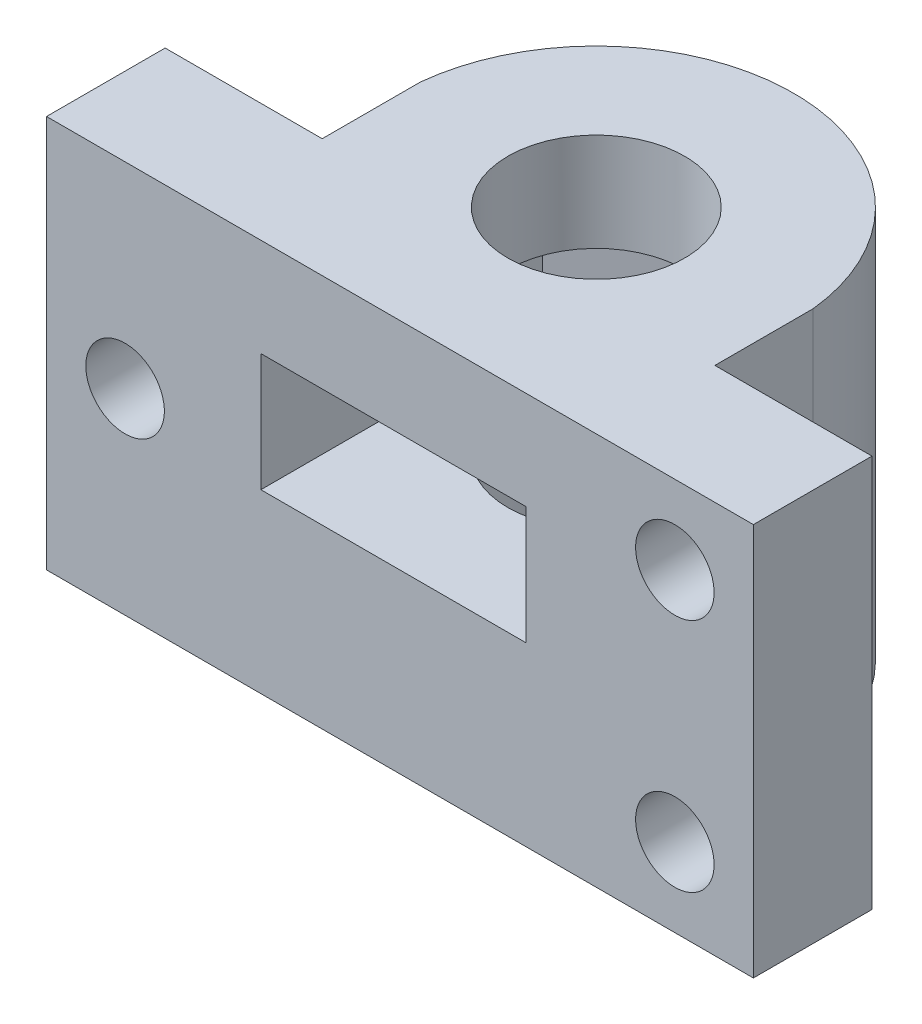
ISO-10303-21;
HEADER;
FILE_DESCRIPTION(('STEP AP214'),'2;1');
FILE_NAME('part.step','',(''),(''),'','','');
FILE_SCHEMA(('AUTOMOTIVE_DESIGN { 1 0 10303 214 1 1 1 1 }'));
ENDSEC;
DATA;
#1=APPLICATION_CONTEXT('core data for automotive mechanical design processes');
#2=APPLICATION_PROTOCOL_DEFINITION('international standard','automotive_design',2000,#1);
#3=PRODUCT_CONTEXT('',#1,'mechanical');
#4=PRODUCT('Part','Part','',(#3));
#5=PRODUCT_RELATED_PRODUCT_CATEGORY('part','',(#4));
#6=PRODUCT_DEFINITION_FORMATION('','',#4);
#7=PRODUCT_DEFINITION_CONTEXT('part definition',#1,'design');
#8=PRODUCT_DEFINITION('design','',#6,#7);
#9=PRODUCT_DEFINITION_SHAPE('','',#8);
#10=(LENGTH_UNIT() NAMED_UNIT(*) SI_UNIT(.MILLI.,.METRE.));
#11=(NAMED_UNIT(*) PLANE_ANGLE_UNIT() SI_UNIT($,.RADIAN.));
#12=(NAMED_UNIT(*) SI_UNIT($,.STERADIAN.) SOLID_ANGLE_UNIT());
#13=UNCERTAINTY_MEASURE_WITH_UNIT(LENGTH_MEASURE(1.E-05),#10,'distance_accuracy_value','');
#14=(GEOMETRIC_REPRESENTATION_CONTEXT(3) GLOBAL_UNCERTAINTY_ASSIGNED_CONTEXT((#13)) GLOBAL_UNIT_ASSIGNED_CONTEXT((#10,
#11,#12)) REPRESENTATION_CONTEXT('',''));
#15=CARTESIAN_POINT('',(0.,0.,0.));
#16=DIRECTION('',(0.,0.,1.));
#17=DIRECTION('',(1.,0.,0.));
#18=AXIS2_PLACEMENT_3D('',#15,#16,#17);
#19=CARTESIAN_POINT('',(10.,20.,-10.));
#20=DIRECTION('',(0.,-1.,0.));
#21=DIRECTION('',(0.,0.,-1.));
#22=AXIS2_PLACEMENT_3D('',#19,#20,#21);
#23=CYLINDRICAL_SURFACE('',#22,4.5);
#24=DIRECTION('',(0.,-1.,0.));
#25=VECTOR('',#24,1.);
#26=CARTESIAN_POINT('',(12.4832774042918,20.,-6.2472232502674));
#27=LINE('',#26,#25);
#28=CARTESIAN_POINT('',(12.4832774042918,9.,-6.2472232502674));
#29=VERTEX_POINT('',#28);
#30=CARTESIAN_POINT('',(12.4832774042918,8.9958407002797,-6.2472232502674));
#31=VERTEX_POINT('',#30);
#32=EDGE_CURVE('E248',#29,#31,#27,.T.);
#33=ORIENTED_EDGE('',*,*,#32,.F.);
#34=CARTESIAN_POINT('',(10.,9.,-10.));
#35=DIRECTION('',(0.,1.,0.));
#36=DIRECTION('',(0.,0.,1.));
#37=AXIS2_PLACEMENT_3D('',#34,#35,#36);
#38=CIRCLE('',#37,4.5);
#39=CARTESIAN_POINT('',(7.51672259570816,9.,-6.2472232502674));
#40=VERTEX_POINT('',#39);
#41=EDGE_CURVE('E178',#29,#40,#38,.T.);
#42=ORIENTED_EDGE('',*,*,#41,.T.);
#43=DIRECTION('',(0.,-1.,0.));
#44=VECTOR('',#43,1.);
#45=CARTESIAN_POINT('',(7.51672259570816,20.,-6.2472232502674));
#46=LINE('',#45,#44);
#47=CARTESIAN_POINT('',(7.51672259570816,8.9958407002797,-6.2472232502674));
#48=VERTEX_POINT('',#47);
#49=EDGE_CURVE('E244',#48,#40,#46,.F.);
#50=ORIENTED_EDGE('',*,*,#49,.F.);
#51=CARTESIAN_POINT('',(10.,8.9958407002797,-10.));
#52=DIRECTION('',(0.,-1.,0.));
#53=DIRECTION('',(0.,0.,-1.));
#54=AXIS2_PLACEMENT_3D('',#51,#52,#53);
#55=CIRCLE('',#54,4.5);
#56=EDGE_CURVE('E259',#31,#48,#55,.T.);
#57=ORIENTED_EDGE('',*,*,#56,.F.);
#58=EDGE_LOOP('',(#33,#42,#50,#57));
#59=FACE_BOUND('',#58,.T.);
#60=CARTESIAN_POINT('',(10.,0.,-10.));
#61=DIRECTION('',(0.,1.,0.));
#62=DIRECTION('',(0.,0.,1.));
#63=AXIS2_PLACEMENT_3D('',#60,#61,#62);
#64=CIRCLE('',#63,4.5);
#65=CARTESIAN_POINT('',(10.,0.,-5.5));
#66=VERTEX_POINT('',#65);
#67=EDGE_CURVE('E182',#66,#66,#64,.T.);
#68=ORIENTED_EDGE('',*,*,#67,.F.);
#69=EDGE_LOOP('',(#68));
#70=FACE_BOUND('',#69,.T.);
#71=ADVANCED_FACE('F33',(#59,#70),#23,.F.);
#72=CARTESIAN_POINT('',(10.,20.,-10.));
#73=DIRECTION('',(0.,-1.,0.));
#74=DIRECTION('',(0.,0.,-1.));
#75=AXIS2_PLACEMENT_3D('',#72,#73,#74);
#76=PLANE('',#75);
#77=DIRECTION('',(1.,0.,0.));
#78=VECTOR('',#77,1.);
#79=CARTESIAN_POINT('',(0.,20.,0.));
#80=LINE('',#79,#78);
#81=CARTESIAN_POINT('',(-8.,20.,0.));
#82=VERTEX_POINT('',#81);
#83=CARTESIAN_POINT('',(28.,20.,0.));
#84=VERTEX_POINT('',#83);
#85=EDGE_CURVE('E96',#82,#84,#80,.T.);
#86=ORIENTED_EDGE('',*,*,#85,.T.);
#87=DIRECTION('',(0.,0.,-1.));
#88=VECTOR('',#87,1.);
#89=CARTESIAN_POINT('',(28.,20.,0.));
#90=LINE('',#89,#88);
#91=CARTESIAN_POINT('',(28.,20.,-6.03995723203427));
#92=VERTEX_POINT('',#91);
#93=EDGE_CURVE('E328',#84,#92,#90,.T.);
#94=ORIENTED_EDGE('',*,*,#93,.T.);
#95=DIRECTION('',(-1.,0.,0.));
#96=VECTOR('',#95,1.);
#97=CARTESIAN_POINT('',(28.,20.,-6.03995723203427));
#98=LINE('',#97,#96);
#99=CARTESIAN_POINT('',(20.,20.,-6.03995723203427));
#100=VERTEX_POINT('',#99);
#101=EDGE_CURVE('E330',#92,#100,#98,.T.);
#102=ORIENTED_EDGE('',*,*,#101,.T.);
#103=DIRECTION('',(0.,0.,-1.));
#104=VECTOR('',#103,1.);
#105=CARTESIAN_POINT('',(20.,20.,-6.03995723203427));
#106=LINE('',#105,#104);
#107=CARTESIAN_POINT('',(20.,20.,-11.0399572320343));
#108=VERTEX_POINT('',#107);
#109=EDGE_CURVE('E332',#100,#108,#106,.T.);
#110=ORIENTED_EDGE('',*,*,#109,.T.);
#111=CARTESIAN_POINT('',(10.,20.,-10.));
#112=DIRECTION('',(0.,1.,0.));
#113=DIRECTION('',(0.,0.,-1.));
#114=AXIS2_PLACEMENT_3D('',#111,#112,#113);
#115=CIRCLE('',#114,10.0539301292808);
#116=CARTESIAN_POINT('',(0.,20.,-11.0399572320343));
#117=VERTEX_POINT('',#116);
#118=EDGE_CURVE('E121',#108,#117,#115,.T.);
#119=ORIENTED_EDGE('',*,*,#118,.T.);
#120=DIRECTION('',(0.,0.,1.));
#121=VECTOR('',#120,1.);
#122=CARTESIAN_POINT('',(0.,20.,-11.0399572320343));
#123=LINE('',#122,#121);
#124=CARTESIAN_POINT('',(0.,20.,-6.03995723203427));
#125=VERTEX_POINT('',#124);
#126=EDGE_CURVE('E113',#117,#125,#123,.T.);
#127=ORIENTED_EDGE('',*,*,#126,.T.);
#128=DIRECTION('',(-1.,0.,0.));
#129=VECTOR('',#128,1.);
#130=CARTESIAN_POINT('',(-8.,20.,-6.03995723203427));
#131=LINE('',#130,#129);
#132=CARTESIAN_POINT('',(-8.,20.,-6.03995723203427));
#133=VERTEX_POINT('',#132);
#134=EDGE_CURVE('E118',#125,#133,#131,.T.);
#135=ORIENTED_EDGE('',*,*,#134,.T.);
#136=DIRECTION('',(0.,0.,1.));
#137=VECTOR('',#136,1.);
#138=CARTESIAN_POINT('',(-8.,20.,0.));
#139=LINE('',#138,#137);
#140=EDGE_CURVE('E57',#133,#82,#139,.T.);
#141=ORIENTED_EDGE('',*,*,#140,.T.);
#142=EDGE_LOOP('',(#86,#94,#102,#110,#119,#127,#135,#141));
#143=FACE_BOUND('',#142,.T.);
#144=CARTESIAN_POINT('',(10.,20.,-10.));
#145=DIRECTION('',(0.,1.,0.));
#146=DIRECTION('',(0.,0.,1.));
#147=AXIS2_PLACEMENT_3D('',#144,#145,#146);
#148=CIRCLE('',#147,4.5);
#149=CARTESIAN_POINT('',(10.,20.,-5.5));
#150=VERTEX_POINT('',#149);
#151=EDGE_CURVE('E145',#150,#150,#148,.T.);
#152=ORIENTED_EDGE('',*,*,#151,.F.);
#153=EDGE_LOOP('',(#152));
#154=FACE_BOUND('',#153,.T.);
#155=ADVANCED_FACE('F115',(#143,#154),#76,.F.);
#156=CARTESIAN_POINT('',(10.,0.,-10.));
#157=DIRECTION('',(0.,-1.,0.));
#158=DIRECTION('',(0.,0.,-1.));
#159=AXIS2_PLACEMENT_3D('',#156,#157,#158);
#160=PLANE('',#159);
#161=DIRECTION('',(1.,0.,0.));
#162=VECTOR('',#161,1.);
#163=CARTESIAN_POINT('',(20.,0.,0.));
#164=LINE('',#163,#162);
#165=CARTESIAN_POINT('',(-8.,0.,0.));
#166=VERTEX_POINT('',#165);
#167=CARTESIAN_POINT('',(28.,0.,0.));
#168=VERTEX_POINT('',#167);
#169=EDGE_CURVE('E90',#166,#168,#164,.T.);
#170=ORIENTED_EDGE('',*,*,#169,.F.);
#171=DIRECTION('',(0.,0.,1.));
#172=VECTOR('',#171,1.);
#173=CARTESIAN_POINT('',(-8.,0.,0.));
#174=LINE('',#173,#172);
#175=CARTESIAN_POINT('',(-8.,0.,-6.03995723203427));
#176=VERTEX_POINT('',#175);
#177=EDGE_CURVE('E156',#176,#166,#174,.T.);
#178=ORIENTED_EDGE('',*,*,#177,.F.);
#179=DIRECTION('',(-1.,0.,0.));
#180=VECTOR('',#179,1.);
#181=CARTESIAN_POINT('',(-8.,0.,-6.03995723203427));
#182=LINE('',#181,#180);
#183=CARTESIAN_POINT('',(0.,0.,-6.03995723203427));
#184=VERTEX_POINT('',#183);
#185=EDGE_CURVE('E154',#184,#176,#182,.T.);
#186=ORIENTED_EDGE('',*,*,#185,.F.);
#187=DIRECTION('',(0.,0.,1.));
#188=VECTOR('',#187,1.);
#189=CARTESIAN_POINT('',(0.,0.,-11.0399572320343));
#190=LINE('',#189,#188);
#191=CARTESIAN_POINT('',(0.,0.,-11.0399572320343));
#192=VERTEX_POINT('',#191);
#193=EDGE_CURVE('E130',#192,#184,#190,.T.);
#194=ORIENTED_EDGE('',*,*,#193,.F.);
#195=CARTESIAN_POINT('',(10.,0.,-10.));
#196=DIRECTION('',(0.,1.,0.));
#197=DIRECTION('',(0.,0.,-1.));
#198=AXIS2_PLACEMENT_3D('',#195,#196,#197);
#199=CIRCLE('',#198,10.0539301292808);
#200=CARTESIAN_POINT('',(20.,0.,-11.0399572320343));
#201=VERTEX_POINT('',#200);
#202=EDGE_CURVE('E151',#201,#192,#199,.T.);
#203=ORIENTED_EDGE('',*,*,#202,.F.);
#204=DIRECTION('',(0.,0.,-1.));
#205=VECTOR('',#204,1.);
#206=CARTESIAN_POINT('',(20.,0.,-6.03995723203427));
#207=LINE('',#206,#205);
#208=CARTESIAN_POINT('',(20.,0.,-6.03995723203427));
#209=VERTEX_POINT('',#208);
#210=EDGE_CURVE('E149',#209,#201,#207,.T.);
#211=ORIENTED_EDGE('',*,*,#210,.F.);
#212=DIRECTION('',(-1.,0.,0.));
#213=VECTOR('',#212,1.);
#214=CARTESIAN_POINT('',(28.,0.,-6.03995723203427));
#215=LINE('',#214,#213);
#216=CARTESIAN_POINT('',(28.,0.,-6.03995723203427));
#217=VERTEX_POINT('',#216);
#218=EDGE_CURVE('E147',#217,#209,#215,.T.);
#219=ORIENTED_EDGE('',*,*,#218,.F.);
#220=DIRECTION('',(0.,0.,-1.));
#221=VECTOR('',#220,1.);
#222=CARTESIAN_POINT('',(28.,0.,0.));
#223=LINE('',#222,#221);
#224=EDGE_CURVE('E144',#168,#217,#223,.T.);
#225=ORIENTED_EDGE('',*,*,#224,.F.);
#226=EDGE_LOOP('',(#170,#178,#186,#194,#203,#211,#219,#225));
#227=FACE_BOUND('',#226,.T.);
#228=ORIENTED_EDGE('',*,*,#67,.T.);
#229=EDGE_LOOP('',(#228));
#230=FACE_BOUND('',#229,.T.);
#231=ADVANCED_FACE('F343',(#227,#230),#160,.T.);
#232=CARTESIAN_POINT('',(20.,20.,0.));
#233=DIRECTION('',(0.,0.,-1.));
#234=DIRECTION('',(-1.,0.,0.));
#235=AXIS2_PLACEMENT_3D('',#232,#233,#234);
#236=PLANE('',#235);
#237=DIRECTION('',(-1.,0.,0.));
#238=VECTOR('',#237,1.);
#239=CARTESIAN_POINT('',(20.,8.9958407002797,0.));
#240=LINE('',#239,#238);
#241=CARTESIAN_POINT('',(16.4104206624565,8.9958407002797,0.));
#242=VERTEX_POINT('',#241);
#243=CARTESIAN_POINT('',(2.91733404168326,8.9958407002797,0.));
#244=VERTEX_POINT('',#243);
#245=EDGE_CURVE('E41',#242,#244,#240,.T.);
#246=ORIENTED_EDGE('',*,*,#245,.T.);
#247=DIRECTION('',(0.,1.,0.));
#248=VECTOR('',#247,1.);
#249=CARTESIAN_POINT('',(2.91733404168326,20.,0.));
#250=LINE('',#249,#248);
#251=CARTESIAN_POINT('',(2.91733404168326,15.0012416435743,0.));
#252=VERTEX_POINT('',#251);
#253=EDGE_CURVE('E11',#244,#252,#250,.T.);
#254=ORIENTED_EDGE('',*,*,#253,.T.);
#255=DIRECTION('',(1.,0.,0.));
#256=VECTOR('',#255,1.);
#257=CARTESIAN_POINT('',(20.,15.0012416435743,0.));
#258=LINE('',#257,#256);
#259=CARTESIAN_POINT('',(16.4104206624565,15.0012416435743,0.));
#260=VERTEX_POINT('',#259);
#261=EDGE_CURVE('E257',#252,#260,#258,.T.);
#262=ORIENTED_EDGE('',*,*,#261,.T.);
#263=DIRECTION('',(0.,-1.,0.));
#264=VECTOR('',#263,1.);
#265=CARTESIAN_POINT('',(16.4104206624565,20.,0.));
#266=LINE('',#265,#264);
#267=EDGE_CURVE('E201',#260,#242,#266,.T.);
#268=ORIENTED_EDGE('',*,*,#267,.T.);
#269=EDGE_LOOP('',(#246,#254,#262,#268));
#270=FACE_BOUND('',#269,.T.);
#271=CARTESIAN_POINT('',(-4.,10.,0.));
#272=DIRECTION('',(0.,0.,-1.));
#273=DIRECTION('',(-1.,0.,0.));
#274=AXIS2_PLACEMENT_3D('',#271,#272,#273);
#275=CIRCLE('',#274,2.);
#276=CARTESIAN_POINT('',(-6.,10.,0.));
#277=VERTEX_POINT('',#276);
#278=EDGE_CURVE('E262',#277,#277,#275,.T.);
#279=ORIENTED_EDGE('',*,*,#278,.T.);
#280=EDGE_LOOP('',(#279));
#281=FACE_BOUND('',#280,.T.);
#282=CARTESIAN_POINT('',(24.,16.,0.));
#283=DIRECTION('',(0.,0.,-1.));
#284=DIRECTION('',(-1.,0.,0.));
#285=AXIS2_PLACEMENT_3D('',#282,#283,#284);
#286=CIRCLE('',#285,2.);
#287=CARTESIAN_POINT('',(22.,16.,0.));
#288=VERTEX_POINT('',#287);
#289=EDGE_CURVE('E268',#288,#288,#286,.T.);
#290=ORIENTED_EDGE('',*,*,#289,.T.);
#291=EDGE_LOOP('',(#290));
#292=FACE_BOUND('',#291,.T.);
#293=CARTESIAN_POINT('',(24.,4.,0.));
#294=DIRECTION('',(0.,0.,-1.));
#295=DIRECTION('',(-1.,0.,0.));
#296=AXIS2_PLACEMENT_3D('',#293,#294,#295);
#297=CIRCLE('',#296,2.);
#298=CARTESIAN_POINT('',(22.,4.,0.));
#299=VERTEX_POINT('',#298);
#300=EDGE_CURVE('E274',#299,#299,#297,.T.);
#301=ORIENTED_EDGE('',*,*,#300,.T.);
#302=EDGE_LOOP('',(#301));
#303=FACE_BOUND('',#302,.T.);
#304=ORIENTED_EDGE('',*,*,#169,.T.);
#305=DIRECTION('',(0.,-1.,0.));
#306=VECTOR('',#305,1.);
#307=CARTESIAN_POINT('',(28.,20.,0.));
#308=LINE('',#307,#306);
#309=EDGE_CURVE('E171',#84,#168,#308,.T.);
#310=ORIENTED_EDGE('',*,*,#309,.F.);
#311=ORIENTED_EDGE('',*,*,#85,.F.);
#312=DIRECTION('',(0.,-1.,0.));
#313=VECTOR('',#312,1.);
#314=CARTESIAN_POINT('',(-8.,20.,0.));
#315=LINE('',#314,#313);
#316=EDGE_CURVE('E139',#82,#166,#315,.T.);
#317=ORIENTED_EDGE('',*,*,#316,.T.);
#318=EDGE_LOOP('',(#304,#310,#311,#317));
#319=FACE_BOUND('',#318,.T.);
#320=ADVANCED_FACE('F35',(#270,#281,#292,#303,#319),#236,.F.);
#321=CARTESIAN_POINT('',(28.,20.,0.));
#322=DIRECTION('',(-1.,0.,0.));
#323=DIRECTION('',(0.,0.,1.));
#324=AXIS2_PLACEMENT_3D('',#321,#322,#323);
#325=PLANE('',#324);
#326=ORIENTED_EDGE('',*,*,#224,.T.);
#327=DIRECTION('',(0.,-1.,0.));
#328=VECTOR('',#327,1.);
#329=CARTESIAN_POINT('',(28.,20.,-6.03995723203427));
#330=LINE('',#329,#328);
#331=EDGE_CURVE('E168',#92,#217,#330,.T.);
#332=ORIENTED_EDGE('',*,*,#331,.F.);
#333=ORIENTED_EDGE('',*,*,#93,.F.);
#334=ORIENTED_EDGE('',*,*,#309,.T.);
#335=EDGE_LOOP('',(#326,#332,#333,#334));
#336=FACE_BOUND('',#335,.T.);
#337=ADVANCED_FACE('F351',(#336),#325,.F.);
#338=CARTESIAN_POINT('',(28.,20.,-6.03995723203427));
#339=DIRECTION('',(0.,0.,1.));
#340=DIRECTION('',(1.,0.,0.));
#341=AXIS2_PLACEMENT_3D('',#338,#339,#340);
#342=PLANE('',#341);
#343=CARTESIAN_POINT('',(24.,16.,-6.03995723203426));
#344=DIRECTION('',(0.,0.,-1.));
#345=DIRECTION('',(-1.,0.,0.));
#346=AXIS2_PLACEMENT_3D('',#343,#344,#345);
#347=CIRCLE('',#346,2.);
#348=CARTESIAN_POINT('',(22.,16.,-6.03995723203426));
#349=VERTEX_POINT('',#348);
#350=EDGE_CURVE('E265',#349,#349,#347,.T.);
#351=ORIENTED_EDGE('',*,*,#350,.F.);
#352=EDGE_LOOP('',(#351));
#353=FACE_BOUND('',#352,.T.);
#354=CARTESIAN_POINT('',(24.,4.,-6.03995723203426));
#355=DIRECTION('',(0.,0.,-1.));
#356=DIRECTION('',(-1.,0.,0.));
#357=AXIS2_PLACEMENT_3D('',#354,#355,#356);
#358=CIRCLE('',#357,2.);
#359=CARTESIAN_POINT('',(22.,4.,-6.03995723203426));
#360=VERTEX_POINT('',#359);
#361=EDGE_CURVE('E271',#360,#360,#358,.T.);
#362=ORIENTED_EDGE('',*,*,#361,.F.);
#363=EDGE_LOOP('',(#362));
#364=FACE_BOUND('',#363,.T.);
#365=ORIENTED_EDGE('',*,*,#218,.T.);
#366=DIRECTION('',(0.,-1.,0.));
#367=VECTOR('',#366,1.);
#368=CARTESIAN_POINT('',(20.,20.,-6.03995723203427));
#369=LINE('',#368,#367);
#370=EDGE_CURVE('E165',#100,#209,#369,.T.);
#371=ORIENTED_EDGE('',*,*,#370,.F.);
#372=ORIENTED_EDGE('',*,*,#101,.F.);
#373=ORIENTED_EDGE('',*,*,#331,.T.);
#374=EDGE_LOOP('',(#365,#371,#372,#373));
#375=FACE_BOUND('',#374,.T.);
#376=ADVANCED_FACE('F354',(#353,#364,#375),#342,.F.);
#377=CARTESIAN_POINT('',(20.,20.,-6.03995723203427));
#378=DIRECTION('',(-1.,0.,0.));
#379=DIRECTION('',(0.,0.,1.));
#380=AXIS2_PLACEMENT_3D('',#377,#378,#379);
#381=PLANE('',#380);
#382=ORIENTED_EDGE('',*,*,#210,.T.);
#383=DIRECTION('',(0.,-1.,0.));
#384=VECTOR('',#383,1.);
#385=CARTESIAN_POINT('',(20.,20.,-11.0399572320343));
#386=LINE('',#385,#384);
#387=EDGE_CURVE('E162',#108,#201,#386,.T.);
#388=ORIENTED_EDGE('',*,*,#387,.F.);
#389=ORIENTED_EDGE('',*,*,#109,.F.);
#390=ORIENTED_EDGE('',*,*,#370,.T.);
#391=EDGE_LOOP('',(#382,#388,#389,#390));
#392=FACE_BOUND('',#391,.T.);
#393=ADVANCED_FACE('F338',(#392),#381,.F.);
#394=CARTESIAN_POINT('',(10.,20.,-10.));
#395=DIRECTION('',(0.,-1.,0.));
#396=DIRECTION('',(0.,0.,-1.));
#397=AXIS2_PLACEMENT_3D('',#394,#395,#396);
#398=CYLINDRICAL_SURFACE('',#397,10.0539301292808);
#399=ORIENTED_EDGE('',*,*,#202,.T.);
#400=DIRECTION('',(0.,-1.,0.));
#401=VECTOR('',#400,1.);
#402=CARTESIAN_POINT('',(0.,20.,-11.0399572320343));
#403=LINE('',#402,#401);
#404=EDGE_CURVE('E133',#117,#192,#403,.T.);
#405=ORIENTED_EDGE('',*,*,#404,.F.);
#406=ORIENTED_EDGE('',*,*,#118,.F.);
#407=ORIENTED_EDGE('',*,*,#387,.T.);
#408=EDGE_LOOP('',(#399,#405,#406,#407));
#409=FACE_BOUND('',#408,.T.);
#410=ADVANCED_FACE('F342',(#409),#398,.T.);
#411=CARTESIAN_POINT('',(0.,20.,-11.0399572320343));
#412=DIRECTION('',(1.,0.,0.));
#413=DIRECTION('',(0.,0.,-1.));
#414=AXIS2_PLACEMENT_3D('',#411,#412,#413);
#415=PLANE('',#414);
#416=ORIENTED_EDGE('',*,*,#193,.T.);
#417=DIRECTION('',(0.,-1.,0.));
#418=VECTOR('',#417,1.);
#419=CARTESIAN_POINT('',(0.,20.,-6.03995723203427));
#420=LINE('',#419,#418);
#421=EDGE_CURVE('E127',#125,#184,#420,.T.);
#422=ORIENTED_EDGE('',*,*,#421,.F.);
#423=ORIENTED_EDGE('',*,*,#126,.F.);
#424=ORIENTED_EDGE('',*,*,#404,.T.);
#425=EDGE_LOOP('',(#416,#422,#423,#424));
#426=FACE_BOUND('',#425,.T.);
#427=ADVANCED_FACE('F128',(#426),#415,.F.);
#428=CARTESIAN_POINT('',(-8.,20.,-6.03995723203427));
#429=DIRECTION('',(0.,0.,1.));
#430=DIRECTION('',(1.,0.,0.));
#431=AXIS2_PLACEMENT_3D('',#428,#429,#430);
#432=PLANE('',#431);
#433=CARTESIAN_POINT('',(-4.,10.,-6.03995723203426));
#434=DIRECTION('',(0.,0.,-1.));
#435=DIRECTION('',(-1.,0.,0.));
#436=AXIS2_PLACEMENT_3D('',#433,#434,#435);
#437=CIRCLE('',#436,2.);
#438=CARTESIAN_POINT('',(-6.,10.,-6.03995723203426));
#439=VERTEX_POINT('',#438);
#440=EDGE_CURVE('E261',#439,#439,#437,.T.);
#441=ORIENTED_EDGE('',*,*,#440,.F.);
#442=EDGE_LOOP('',(#441));
#443=FACE_BOUND('',#442,.T.);
#444=ORIENTED_EDGE('',*,*,#185,.T.);
#445=DIRECTION('',(0.,-1.,0.));
#446=VECTOR('',#445,1.);
#447=CARTESIAN_POINT('',(-8.,20.,-6.03995723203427));
#448=LINE('',#447,#446);
#449=EDGE_CURVE('E134',#133,#176,#448,.T.);
#450=ORIENTED_EDGE('',*,*,#449,.F.);
#451=ORIENTED_EDGE('',*,*,#134,.F.);
#452=ORIENTED_EDGE('',*,*,#421,.T.);
#453=EDGE_LOOP('',(#444,#450,#451,#452));
#454=FACE_BOUND('',#453,.T.);
#455=ADVANCED_FACE('F136',(#443,#454),#432,.F.);
#456=CARTESIAN_POINT('',(-8.,20.,0.));
#457=DIRECTION('',(1.,0.,0.));
#458=DIRECTION('',(0.,0.,-1.));
#459=AXIS2_PLACEMENT_3D('',#456,#457,#458);
#460=PLANE('',#459);
#461=ORIENTED_EDGE('',*,*,#177,.T.);
#462=ORIENTED_EDGE('',*,*,#316,.F.);
#463=ORIENTED_EDGE('',*,*,#140,.F.);
#464=ORIENTED_EDGE('',*,*,#449,.T.);
#465=EDGE_LOOP('',(#461,#462,#463,#464));
#466=FACE_BOUND('',#465,.T.);
#467=ADVANCED_FACE('F346',(#466),#460,.F.);
#468=DIRECTION('',(0.,-1.,0.));
#469=VECTOR('',#468,1.);
#470=CARTESIAN_POINT('',(12.4832774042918,20.,-6.2472232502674));
#471=LINE('',#470,#469);
#472=CARTESIAN_POINT('',(12.4832774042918,15.0012416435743,-6.2472232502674));
#473=VERTEX_POINT('',#472);
#474=CARTESIAN_POINT('',(12.4832774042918,15.,-6.2472232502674));
#475=VERTEX_POINT('',#474);
#476=EDGE_CURVE('E238',#473,#475,#471,.T.);
#477=ORIENTED_EDGE('',*,*,#476,.F.);
#478=CARTESIAN_POINT('',(10.,15.0012416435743,-10.));
#479=DIRECTION('',(0.,1.,0.));
#480=DIRECTION('',(0.,0.,1.));
#481=AXIS2_PLACEMENT_3D('',#478,#479,#480);
#482=CIRCLE('',#481,4.5);
#483=CARTESIAN_POINT('',(7.51672259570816,15.0012416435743,-6.2472232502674));
#484=VERTEX_POINT('',#483);
#485=EDGE_CURVE('E189',#484,#473,#482,.T.);
#486=ORIENTED_EDGE('',*,*,#485,.F.);
#487=DIRECTION('',(0.,-1.,0.));
#488=VECTOR('',#487,1.);
#489=CARTESIAN_POINT('',(7.51672259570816,20.,-6.2472232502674));
#490=LINE('',#489,#488);
#491=CARTESIAN_POINT('',(7.51672259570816,15.,-6.2472232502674));
#492=VERTEX_POINT('',#491);
#493=EDGE_CURVE('E227',#492,#484,#490,.F.);
#494=ORIENTED_EDGE('',*,*,#493,.F.);
#495=CARTESIAN_POINT('',(10.,15.,-10.));
#496=DIRECTION('',(0.,1.,0.));
#497=DIRECTION('',(0.,0.,1.));
#498=AXIS2_PLACEMENT_3D('',#495,#496,#497);
#499=CIRCLE('',#498,4.5);
#500=EDGE_CURVE('E175',#475,#492,#499,.T.);
#501=ORIENTED_EDGE('',*,*,#500,.F.);
#502=EDGE_LOOP('',(#477,#486,#494,#501));
#503=FACE_BOUND('',#502,.T.);
#504=ORIENTED_EDGE('',*,*,#151,.T.);
#505=EDGE_LOOP('',(#504));
#506=FACE_BOUND('',#505,.T.);
#507=ADVANCED_FACE('F368',(#503,#506),#23,.F.);
#508=CARTESIAN_POINT('',(3.49999999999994,9.,-13.7527767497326));
#509=DIRECTION('',(-1.,0.,0.));
#510=DIRECTION('',(0.,0.,1.));
#511=AXIS2_PLACEMENT_3D('',#508,#509,#510);
#512=PLANE('',#511);
#513=DIRECTION('',(0.,0.,1.));
#514=VECTOR('',#513,1.);
#515=CARTESIAN_POINT('',(3.49999999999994,15.,-13.7527767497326));
#516=LINE('',#515,#514);
#517=CARTESIAN_POINT('',(3.49999999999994,15.,-13.7527767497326));
#518=VERTEX_POINT('',#517);
#519=CARTESIAN_POINT('',(3.49999999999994,15.,-6.2472232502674));
#520=VERTEX_POINT('',#519);
#521=EDGE_CURVE('E284',#518,#520,#516,.T.);
#522=ORIENTED_EDGE('',*,*,#521,.T.);
#523=DIRECTION('',(0.,1.,0.));
#524=VECTOR('',#523,1.);
#525=CARTESIAN_POINT('',(3.49999999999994,9.,-6.2472232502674));
#526=LINE('',#525,#524);
#527=CARTESIAN_POINT('',(3.49999999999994,9.,-6.2472232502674));
#528=VERTEX_POINT('',#527);
#529=EDGE_CURVE('E179',#528,#520,#526,.T.);
#530=ORIENTED_EDGE('',*,*,#529,.F.);
#531=DIRECTION('',(0.,0.,1.));
#532=VECTOR('',#531,1.);
#533=CARTESIAN_POINT('',(3.49999999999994,9.,-13.7527767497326));
#534=LINE('',#533,#532);
#535=CARTESIAN_POINT('',(3.49999999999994,9.,-13.7527767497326));
#536=VERTEX_POINT('',#535);
#537=EDGE_CURVE('E293',#536,#528,#534,.T.);
#538=ORIENTED_EDGE('',*,*,#537,.F.);
#539=DIRECTION('',(0.,1.,0.));
#540=VECTOR('',#539,1.);
#541=CARTESIAN_POINT('',(3.49999999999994,9.,-13.7527767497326));
#542=LINE('',#541,#540);
#543=EDGE_CURVE('E312',#536,#518,#542,.T.);
#544=ORIENTED_EDGE('',*,*,#543,.T.);
#545=EDGE_LOOP('',(#522,#530,#538,#544));
#546=FACE_BOUND('',#545,.T.);
#547=ADVANCED_FACE('F377',(#546),#512,.F.);
#548=CARTESIAN_POINT('',(10.,9.,-17.5055534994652));
#549=DIRECTION('',(-0.5,0.,-0.866025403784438));
#550=DIRECTION('',(-0.866025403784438,0.,0.5));
#551=AXIS2_PLACEMENT_3D('',#548,#549,#550);
#552=PLANE('',#551);
#553=DIRECTION('',(-0.866025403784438,0.,0.5));
#554=VECTOR('',#553,1.);
#555=CARTESIAN_POINT('',(10.,15.,-17.5055534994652));
#556=LINE('',#555,#554);
#557=CARTESIAN_POINT('',(10.,15.,-17.5055534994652));
#558=VERTEX_POINT('',#557);
#559=EDGE_CURVE('E305',#558,#518,#556,.T.);
#560=ORIENTED_EDGE('',*,*,#559,.T.);
#561=ORIENTED_EDGE('',*,*,#543,.F.);
#562=DIRECTION('',(-0.866025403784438,0.,0.5));
#563=VECTOR('',#562,1.);
#564=CARTESIAN_POINT('',(10.,9.,-17.5055534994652));
#565=LINE('',#564,#563);
#566=CARTESIAN_POINT('',(10.,9.,-17.5055534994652));
#567=VERTEX_POINT('',#566);
#568=EDGE_CURVE('E290',#567,#536,#565,.T.);
#569=ORIENTED_EDGE('',*,*,#568,.F.);
#570=DIRECTION('',(0.,1.,0.));
#571=VECTOR('',#570,1.);
#572=CARTESIAN_POINT('',(10.,9.,-17.5055534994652));
#573=LINE('',#572,#571);
#574=EDGE_CURVE('E315',#567,#558,#573,.T.);
#575=ORIENTED_EDGE('',*,*,#574,.T.);
#576=EDGE_LOOP('',(#560,#561,#569,#575));
#577=FACE_BOUND('',#576,.T.);
#578=ADVANCED_FACE('F383',(#577),#552,.F.);
#579=CARTESIAN_POINT('',(16.5000000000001,9.,-13.7527767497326));
#580=DIRECTION('',(0.5,0.,-0.866025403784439));
#581=DIRECTION('',(-0.866025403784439,0.,-0.5));
#582=AXIS2_PLACEMENT_3D('',#579,#580,#581);
#583=PLANE('',#582);
#584=DIRECTION('',(-0.866025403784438,0.,-0.5));
#585=VECTOR('',#584,1.);
#586=CARTESIAN_POINT('',(16.5000000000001,15.,-13.7527767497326));
#587=LINE('',#586,#585);
#588=CARTESIAN_POINT('',(16.5000000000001,15.,-13.7527767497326));
#589=VERTEX_POINT('',#588);
#590=EDGE_CURVE('E302',#589,#558,#587,.T.);
#591=ORIENTED_EDGE('',*,*,#590,.T.);
#592=ORIENTED_EDGE('',*,*,#574,.F.);
#593=DIRECTION('',(-0.866025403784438,0.,-0.5));
#594=VECTOR('',#593,1.);
#595=CARTESIAN_POINT('',(16.5000000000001,9.,-13.7527767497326));
#596=LINE('',#595,#594);
#597=CARTESIAN_POINT('',(16.5000000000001,9.,-13.7527767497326));
#598=VERTEX_POINT('',#597);
#599=EDGE_CURVE('E287',#598,#567,#596,.T.);
#600=ORIENTED_EDGE('',*,*,#599,.F.);
#601=DIRECTION('',(0.,1.,0.));
#602=VECTOR('',#601,1.);
#603=CARTESIAN_POINT('',(16.5000000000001,9.,-13.7527767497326));
#604=LINE('',#603,#602);
#605=EDGE_CURVE('E318',#598,#589,#604,.T.);
#606=ORIENTED_EDGE('',*,*,#605,.T.);
#607=EDGE_LOOP('',(#591,#592,#600,#606));
#608=FACE_BOUND('',#607,.T.);
#609=ADVANCED_FACE('F493',(#608),#583,.F.);
#610=CARTESIAN_POINT('',(16.5000000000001,9.,-6.2472232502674));
#611=DIRECTION('',(1.,0.,0.));
#612=DIRECTION('',(0.,0.,-1.));
#613=AXIS2_PLACEMENT_3D('',#610,#611,#612);
#614=PLANE('',#613);
#615=DIRECTION('',(0.,0.,-1.));
#616=VECTOR('',#615,1.);
#617=CARTESIAN_POINT('',(16.5000000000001,15.,-6.2472232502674));
#618=LINE('',#617,#616);
#619=CARTESIAN_POINT('',(16.5000000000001,15.,-6.2472232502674));
#620=VERTEX_POINT('',#619);
#621=EDGE_CURVE('E299',#620,#589,#618,.T.);
#622=ORIENTED_EDGE('',*,*,#621,.T.);
#623=ORIENTED_EDGE('',*,*,#605,.F.);
#624=DIRECTION('',(0.,0.,-1.));
#625=VECTOR('',#624,1.);
#626=CARTESIAN_POINT('',(16.5000000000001,9.,-6.2472232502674));
#627=LINE('',#626,#625);
#628=CARTESIAN_POINT('',(16.5000000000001,9.,-6.2472232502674));
#629=VERTEX_POINT('',#628);
#630=EDGE_CURVE('E283',#629,#598,#627,.T.);
#631=ORIENTED_EDGE('',*,*,#630,.F.);
#632=DIRECTION('',(0.,1.,0.));
#633=VECTOR('',#632,1.);
#634=CARTESIAN_POINT('',(16.5000000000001,9.,-6.2472232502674));
#635=LINE('',#634,#633);
#636=EDGE_CURVE('E296',#629,#620,#635,.T.);
#637=ORIENTED_EDGE('',*,*,#636,.T.);
#638=EDGE_LOOP('',(#622,#623,#631,#637));
#639=FACE_BOUND('',#638,.T.);
#640=ADVANCED_FACE('F495',(#639),#614,.F.);
#641=CARTESIAN_POINT('',(10.,9.,-2.4944465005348));
#642=DIRECTION('',(0.5,0.,0.866025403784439));
#643=DIRECTION('',(0.866025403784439,0.,-0.5));
#644=AXIS2_PLACEMENT_3D('',#641,#642,#643);
#645=PLANE('',#644);
#646=DIRECTION('',(0.866025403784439,0.,-0.5));
#647=VECTOR('',#646,1.);
#648=CARTESIAN_POINT('',(10.,9.,-2.4944465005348));
#649=LINE('',#648,#647);
#650=CARTESIAN_POINT('',(16.4104206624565,9.,-6.19550459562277));
#651=VERTEX_POINT('',#650);
#652=EDGE_CURVE('E280',#651,#629,#649,.T.);
#653=ORIENTED_EDGE('',*,*,#652,.F.);
#654=DIRECTION('',(0.,1.,0.));
#655=VECTOR('',#654,1.);
#656=CARTESIAN_POINT('',(16.4104206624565,9.,-6.19550459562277));
#657=LINE('',#656,#655);
#658=CARTESIAN_POINT('',(16.4104206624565,15.,-6.19550459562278));
#659=VERTEX_POINT('',#658);
#660=EDGE_CURVE('E251',#651,#659,#657,.T.);
#661=ORIENTED_EDGE('',*,*,#660,.T.);
#662=DIRECTION('',(0.866025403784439,0.,-0.5));
#663=VECTOR('',#662,1.);
#664=CARTESIAN_POINT('',(10.,15.,-2.4944465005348));
#665=LINE('',#664,#663);
#666=EDGE_CURVE('E277',#659,#620,#665,.T.);
#667=ORIENTED_EDGE('',*,*,#666,.T.);
#668=ORIENTED_EDGE('',*,*,#636,.F.);
#669=EDGE_LOOP('',(#653,#661,#667,#668));
#670=FACE_BOUND('',#669,.T.);
#671=ADVANCED_FACE('F424',(#670),#645,.F.);
#672=CARTESIAN_POINT('',(0.,9.,0.));
#673=DIRECTION('',(0.,1.,0.));
#674=DIRECTION('',(0.,0.,1.));
#675=AXIS2_PLACEMENT_3D('',#672,#673,#674);
#676=PLANE('',#675);
#677=DIRECTION('',(0.,0.,-1.));
#678=VECTOR('',#677,1.);
#679=CARTESIAN_POINT('',(16.4104206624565,9.,0.));
#680=LINE('',#679,#678);
#681=CARTESIAN_POINT('',(16.4104206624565,9.,-6.2472232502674));
#682=VERTEX_POINT('',#681);
#683=EDGE_CURVE('E254',#651,#682,#680,.T.);
#684=ORIENTED_EDGE('',*,*,#683,.F.);
#685=ORIENTED_EDGE('',*,*,#652,.T.);
#686=ORIENTED_EDGE('',*,*,#630,.T.);
#687=ORIENTED_EDGE('',*,*,#599,.T.);
#688=ORIENTED_EDGE('',*,*,#568,.T.);
#689=ORIENTED_EDGE('',*,*,#537,.T.);
#690=DIRECTION('',(-1.,0.,0.));
#691=VECTOR('',#690,1.);
#692=CARTESIAN_POINT('',(0.,9.,-6.2472232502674));
#693=LINE('',#692,#691);
#694=EDGE_CURVE('E241',#40,#528,#693,.T.);
#695=ORIENTED_EDGE('',*,*,#694,.F.);
#696=ORIENTED_EDGE('',*,*,#41,.F.);
#697=EDGE_CURVE('E245',#682,#29,#693,.T.);
#698=ORIENTED_EDGE('',*,*,#697,.F.);
#699=EDGE_LOOP('',(#684,#685,#686,#687,#688,#689,#695,#696,#698));
#700=FACE_BOUND('',#699,.T.);
#701=ADVANCED_FACE('F430',(#700),#676,.T.);
#702=CARTESIAN_POINT('',(0.,15.,0.));
#703=DIRECTION('',(0.,1.,0.));
#704=DIRECTION('',(0.,0.,1.));
#705=AXIS2_PLACEMENT_3D('',#702,#703,#704);
#706=PLANE('',#705);
#707=ORIENTED_EDGE('',*,*,#666,.F.);
#708=DIRECTION('',(0.,0.,-1.));
#709=VECTOR('',#708,1.);
#710=CARTESIAN_POINT('',(16.4104206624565,15.,0.));
#711=LINE('',#710,#709);
#712=CARTESIAN_POINT('',(16.4104206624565,15.,-6.2472232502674));
#713=VERTEX_POINT('',#712);
#714=EDGE_CURVE('E186',#659,#713,#711,.T.);
#715=ORIENTED_EDGE('',*,*,#714,.T.);
#716=DIRECTION('',(-1.,0.,0.));
#717=VECTOR('',#716,1.);
#718=CARTESIAN_POINT('',(0.,15.,-6.2472232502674));
#719=LINE('',#718,#717);
#720=EDGE_CURVE('E185',#713,#475,#719,.T.);
#721=ORIENTED_EDGE('',*,*,#720,.T.);
#722=ORIENTED_EDGE('',*,*,#500,.T.);
#723=EDGE_CURVE('E174',#492,#520,#719,.T.);
#724=ORIENTED_EDGE('',*,*,#723,.T.);
#725=ORIENTED_EDGE('',*,*,#521,.F.);
#726=ORIENTED_EDGE('',*,*,#559,.F.);
#727=ORIENTED_EDGE('',*,*,#590,.F.);
#728=ORIENTED_EDGE('',*,*,#621,.F.);
#729=EDGE_LOOP('',(#707,#715,#721,#722,#724,#725,#726,#727,#728));
#730=FACE_BOUND('',#729,.T.);
#731=ADVANCED_FACE('F411',(#730),#706,.F.);
#732=CARTESIAN_POINT('',(24.,4.,0.));
#733=DIRECTION('',(0.,0.,-1.));
#734=DIRECTION('',(-1.,0.,0.));
#735=AXIS2_PLACEMENT_3D('',#732,#733,#734);
#736=CYLINDRICAL_SURFACE('',#735,2.);
#737=ORIENTED_EDGE('',*,*,#300,.F.);
#738=EDGE_LOOP('',(#737));
#739=FACE_BOUND('',#738,.T.);
#740=ORIENTED_EDGE('',*,*,#361,.T.);
#741=EDGE_LOOP('',(#740));
#742=FACE_BOUND('',#741,.T.);
#743=ADVANCED_FACE('F508',(#739,#742),#736,.F.);
#744=CARTESIAN_POINT('',(24.,16.,0.));
#745=DIRECTION('',(0.,0.,-1.));
#746=DIRECTION('',(-1.,0.,0.));
#747=AXIS2_PLACEMENT_3D('',#744,#745,#746);
#748=CYLINDRICAL_SURFACE('',#747,2.);
#749=ORIENTED_EDGE('',*,*,#289,.F.);
#750=EDGE_LOOP('',(#749));
#751=FACE_BOUND('',#750,.T.);
#752=ORIENTED_EDGE('',*,*,#350,.T.);
#753=EDGE_LOOP('',(#752));
#754=FACE_BOUND('',#753,.T.);
#755=ADVANCED_FACE('F513',(#751,#754),#748,.F.);
#756=CARTESIAN_POINT('',(-4.,10.,0.));
#757=DIRECTION('',(0.,0.,-1.));
#758=DIRECTION('',(-1.,0.,0.));
#759=AXIS2_PLACEMENT_3D('',#756,#757,#758);
#760=CYLINDRICAL_SURFACE('',#759,2.);
#761=ORIENTED_EDGE('',*,*,#278,.F.);
#762=EDGE_LOOP('',(#761));
#763=FACE_BOUND('',#762,.T.);
#764=ORIENTED_EDGE('',*,*,#440,.T.);
#765=EDGE_LOOP('',(#764));
#766=FACE_BOUND('',#765,.T.);
#767=ADVANCED_FACE('F517',(#763,#766),#760,.F.);
#768=CARTESIAN_POINT('',(2.91733404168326,8.9958407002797,3.7527767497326));
#769=DIRECTION('',(-1.,0.,0.));
#770=DIRECTION('',(0.,0.,1.));
#771=AXIS2_PLACEMENT_3D('',#768,#769,#770);
#772=PLANE('',#771);
#773=DIRECTION('',(0.,0.,-1.));
#774=VECTOR('',#773,1.);
#775=CARTESIAN_POINT('',(2.91733404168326,8.9958407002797,3.7527767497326));
#776=LINE('',#775,#774);
#777=CARTESIAN_POINT('',(2.91733404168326,8.9958407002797,-6.2472232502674));
#778=VERTEX_POINT('',#777);
#779=EDGE_CURVE('E216',#244,#778,#776,.T.);
#780=ORIENTED_EDGE('',*,*,#779,.T.);
#781=DIRECTION('',(0.,1.,0.));
#782=VECTOR('',#781,1.);
#783=CARTESIAN_POINT('',(2.91733404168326,8.9958407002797,-6.2472232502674));
#784=LINE('',#783,#782);
#785=CARTESIAN_POINT('',(2.91733404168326,15.0012416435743,-6.2472232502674));
#786=VERTEX_POINT('',#785);
#787=EDGE_CURVE('E476',#778,#786,#784,.T.);
#788=ORIENTED_EDGE('',*,*,#787,.T.);
#789=DIRECTION('',(0.,0.,-1.));
#790=VECTOR('',#789,1.);
#791=CARTESIAN_POINT('',(2.91733404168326,15.0012416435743,3.7527767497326));
#792=LINE('',#791,#790);
#793=EDGE_CURVE('E229',#252,#786,#792,.T.);
#794=ORIENTED_EDGE('',*,*,#793,.F.);
#795=ORIENTED_EDGE('',*,*,#253,.F.);
#796=EDGE_LOOP('',(#780,#788,#794,#795));
#797=FACE_BOUND('',#796,.T.);
#798=ADVANCED_FACE('F474',(#797),#772,.F.);
#799=CARTESIAN_POINT('',(2.91733404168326,8.9958407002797,3.7527767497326));
#800=DIRECTION('',(0.,-1.,0.));
#801=DIRECTION('',(0.,0.,-1.));
#802=AXIS2_PLACEMENT_3D('',#799,#800,#801);
#803=PLANE('',#802);
#804=ORIENTED_EDGE('',*,*,#56,.T.);
#805=DIRECTION('',(-1.,0.,0.));
#806=VECTOR('',#805,1.);
#807=CARTESIAN_POINT('',(2.91733404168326,8.9958407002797,-6.2472232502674));
#808=LINE('',#807,#806);
#809=EDGE_CURVE('E485',#48,#778,#808,.T.);
#810=ORIENTED_EDGE('',*,*,#809,.T.);
#811=ORIENTED_EDGE('',*,*,#779,.F.);
#812=ORIENTED_EDGE('',*,*,#245,.F.);
#813=DIRECTION('',(0.,0.,-1.));
#814=VECTOR('',#813,1.);
#815=CARTESIAN_POINT('',(16.4104206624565,8.9958407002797,3.7527767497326));
#816=LINE('',#815,#814);
#817=CARTESIAN_POINT('',(16.4104206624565,8.9958407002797,-6.2472232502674));
#818=VERTEX_POINT('',#817);
#819=EDGE_CURVE('E212',#242,#818,#816,.T.);
#820=ORIENTED_EDGE('',*,*,#819,.T.);
#821=EDGE_CURVE('E235',#818,#31,#808,.T.);
#822=ORIENTED_EDGE('',*,*,#821,.T.);
#823=EDGE_LOOP('',(#804,#810,#811,#812,#820,#822));
#824=FACE_BOUND('',#823,.T.);
#825=ADVANCED_FACE('F209',(#824),#803,.F.);
#826=CARTESIAN_POINT('',(2.91733404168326,15.0012416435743,3.7527767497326));
#827=DIRECTION('',(0.,1.,0.));
#828=DIRECTION('',(0.,0.,1.));
#829=AXIS2_PLACEMENT_3D('',#826,#827,#828);
#830=PLANE('',#829);
#831=ORIENTED_EDGE('',*,*,#793,.T.);
#832=DIRECTION('',(1.,0.,0.));
#833=VECTOR('',#832,1.);
#834=CARTESIAN_POINT('',(2.91733404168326,15.0012416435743,-6.2472232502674));
#835=LINE('',#834,#833);
#836=EDGE_CURVE('E482',#786,#484,#835,.T.);
#837=ORIENTED_EDGE('',*,*,#836,.T.);
#838=ORIENTED_EDGE('',*,*,#485,.T.);
#839=CARTESIAN_POINT('',(16.4104206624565,15.0012416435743,-6.2472232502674));
#840=VERTEX_POINT('',#839);
#841=EDGE_CURVE('E405',#473,#840,#835,.T.);
#842=ORIENTED_EDGE('',*,*,#841,.T.);
#843=DIRECTION('',(0.,0.,-1.));
#844=VECTOR('',#843,1.);
#845=CARTESIAN_POINT('',(16.4104206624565,15.0012416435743,3.7527767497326));
#846=LINE('',#845,#844);
#847=EDGE_CURVE('E48',#260,#840,#846,.T.);
#848=ORIENTED_EDGE('',*,*,#847,.F.);
#849=ORIENTED_EDGE('',*,*,#261,.F.);
#850=EDGE_LOOP('',(#831,#837,#838,#842,#848,#849));
#851=FACE_BOUND('',#850,.T.);
#852=ADVANCED_FACE('F470',(#851),#830,.F.);
#853=CARTESIAN_POINT('',(16.4104206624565,8.9958407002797,3.7527767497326));
#854=DIRECTION('',(1.,0.,0.));
#855=DIRECTION('',(0.,0.,-1.));
#856=AXIS2_PLACEMENT_3D('',#853,#854,#855);
#857=PLANE('',#856);
#858=ORIENTED_EDGE('',*,*,#847,.T.);
#859=DIRECTION('',(0.,-1.,0.));
#860=VECTOR('',#859,1.);
#861=CARTESIAN_POINT('',(16.4104206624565,8.9958407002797,-6.2472232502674));
#862=LINE('',#861,#860);
#863=EDGE_CURVE('E420',#840,#713,#862,.T.);
#864=ORIENTED_EDGE('',*,*,#863,.T.);
#865=ORIENTED_EDGE('',*,*,#714,.F.);
#866=ORIENTED_EDGE('',*,*,#660,.F.);
#867=ORIENTED_EDGE('',*,*,#683,.T.);
#868=EDGE_CURVE('E224',#682,#818,#862,.T.);
#869=ORIENTED_EDGE('',*,*,#868,.T.);
#870=ORIENTED_EDGE('',*,*,#819,.F.);
#871=ORIENTED_EDGE('',*,*,#267,.F.);
#872=EDGE_LOOP('',(#858,#864,#865,#866,#867,#869,#870,#871));
#873=FACE_BOUND('',#872,.T.);
#874=ADVANCED_FACE('F221',(#873),#857,.F.);
#875=CARTESIAN_POINT('',(0.,0.,-6.2472232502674));
#876=DIRECTION('',(0.,0.,-1.));
#877=DIRECTION('',(-1.,0.,0.));
#878=AXIS2_PLACEMENT_3D('',#875,#876,#877);
#879=PLANE('',#878);
#880=ORIENTED_EDGE('',*,*,#32,.T.);
#881=ORIENTED_EDGE('',*,*,#821,.F.);
#882=ORIENTED_EDGE('',*,*,#868,.F.);
#883=ORIENTED_EDGE('',*,*,#697,.T.);
#884=EDGE_LOOP('',(#880,#881,#882,#883));
#885=FACE_BOUND('',#884,.T.);
#886=ADVANCED_FACE('F528',(#885),#879,.F.);
#887=ORIENTED_EDGE('',*,*,#49,.T.);
#888=ORIENTED_EDGE('',*,*,#694,.T.);
#889=ORIENTED_EDGE('',*,*,#529,.T.);
#890=ORIENTED_EDGE('',*,*,#723,.F.);
#891=ORIENTED_EDGE('',*,*,#493,.T.);
#892=ORIENTED_EDGE('',*,*,#836,.F.);
#893=ORIENTED_EDGE('',*,*,#787,.F.);
#894=ORIENTED_EDGE('',*,*,#809,.F.);
#895=EDGE_LOOP('',(#887,#888,#889,#890,#891,#892,#893,#894));
#896=FACE_BOUND('',#895,.T.);
#897=ADVANCED_FACE('F457',(#896),#879,.F.);
#898=ORIENTED_EDGE('',*,*,#476,.T.);
#899=ORIENTED_EDGE('',*,*,#720,.F.);
#900=ORIENTED_EDGE('',*,*,#863,.F.);
#901=ORIENTED_EDGE('',*,*,#841,.F.);
#902=EDGE_LOOP('',(#898,#899,#900,#901));
#903=FACE_BOUND('',#902,.T.);
#904=ADVANCED_FACE('F402',(#903),#879,.F.);
#905=CLOSED_SHELL('',(#71,#155,#231,#320,#337,#376,#393,#410,#427,#455,#467,#507,#547,#578,#609,
#640,#671,#701,#731,#743,#755,#767,#798,#825,#852,#874,#886,#897,#904));
#906=MANIFOLD_SOLID_BREP('B2',#905);
#907=ADVANCED_BREP_SHAPE_REPRESENTATION('',(#18,#906),#14);
#908=SHAPE_DEFINITION_REPRESENTATION(#9,#907);
ENDSEC;
END-ISO-10303-21;
